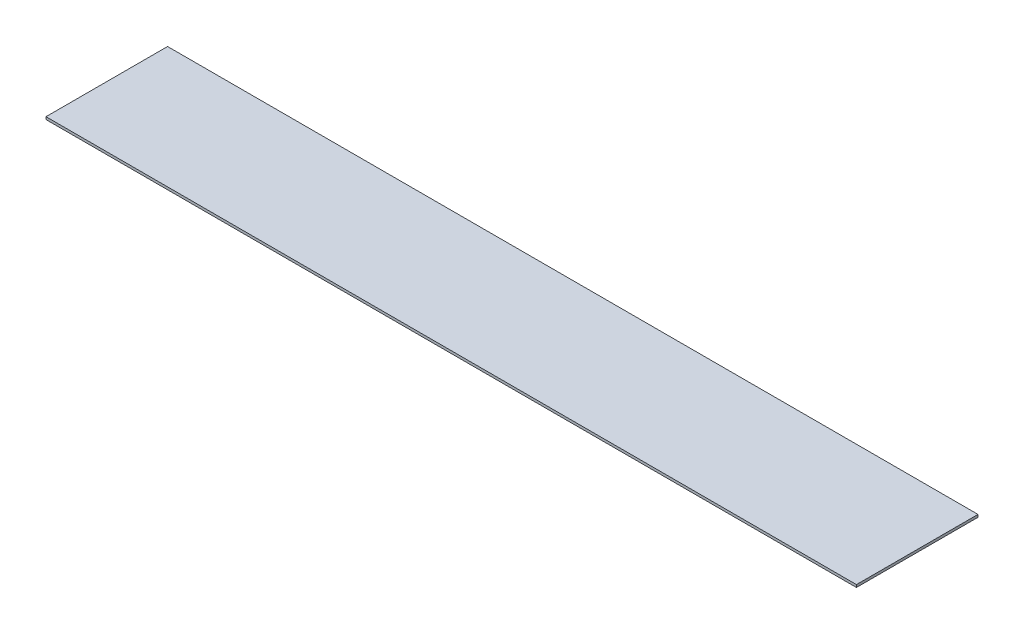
from build123d import *

# Parameters (mm, degrees)
SKETCH1_W      = 2032
SKETCH1_H      = 304.8
EXTRUDE1_DEPTH = 3.175


with BuildPart() as part:
    # Sketch1 → Extrude1 (new, symmetric)
    with BuildSketch(Plane(origin=(0, 0, 0), x_dir=(1, 0, 0), z_dir=(0, 1, 0))):
        Rectangle(SKETCH1_W, SKETCH1_H)
    extrude(amount=EXTRUDE1_DEPTH, both=True)


solid = part.part
